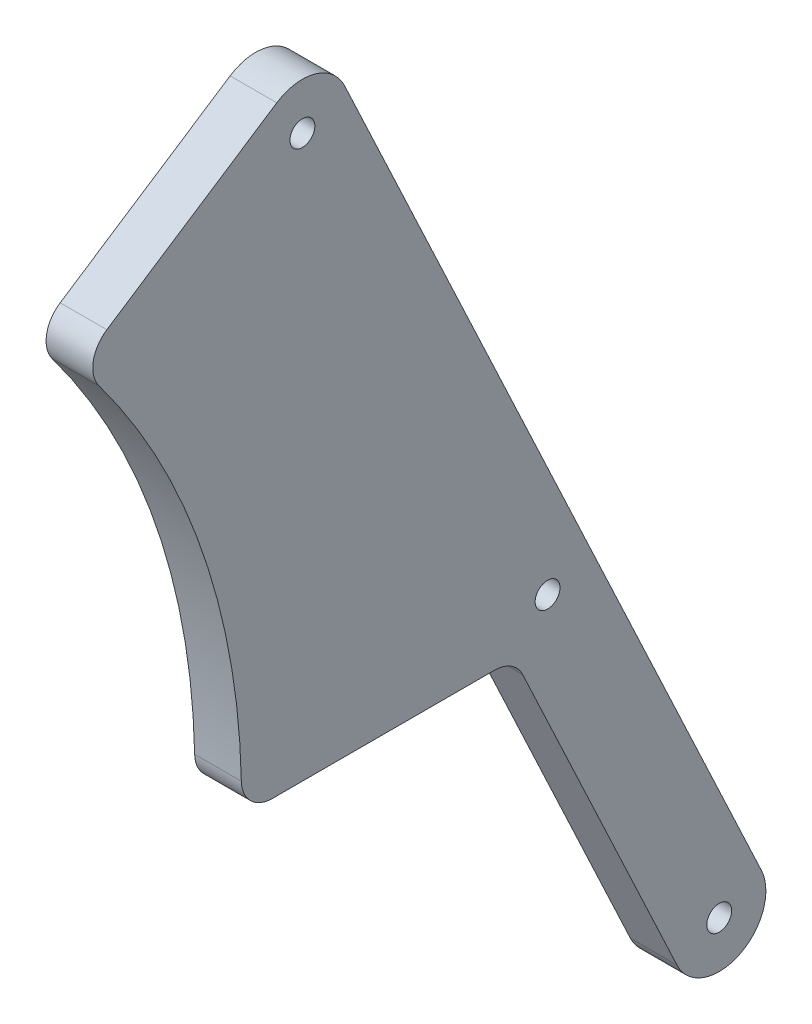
ISO-10303-21;
HEADER;
FILE_DESCRIPTION(('STEP AP214'),'2;1');
FILE_NAME('part.step','',(''),(''),'','','');
FILE_SCHEMA(('AUTOMOTIVE_DESIGN { 1 0 10303 214 1 1 1 1 }'));
ENDSEC;
DATA;
#1=APPLICATION_CONTEXT('core data for automotive mechanical design processes');
#2=APPLICATION_PROTOCOL_DEFINITION('international standard','automotive_design',2000,#1);
#3=PRODUCT_CONTEXT('',#1,'mechanical');
#4=PRODUCT('Part','Part','',(#3));
#5=PRODUCT_RELATED_PRODUCT_CATEGORY('part','',(#4));
#6=PRODUCT_DEFINITION_FORMATION('','',#4);
#7=PRODUCT_DEFINITION_CONTEXT('part definition',#1,'design');
#8=PRODUCT_DEFINITION('design','',#6,#7);
#9=PRODUCT_DEFINITION_SHAPE('','',#8);
#10=(LENGTH_UNIT() NAMED_UNIT(*) SI_UNIT(.MILLI.,.METRE.));
#11=(NAMED_UNIT(*) PLANE_ANGLE_UNIT() SI_UNIT($,.RADIAN.));
#12=(NAMED_UNIT(*) SI_UNIT($,.STERADIAN.) SOLID_ANGLE_UNIT());
#13=UNCERTAINTY_MEASURE_WITH_UNIT(LENGTH_MEASURE(1.E-05),#10,'distance_accuracy_value','');
#14=(GEOMETRIC_REPRESENTATION_CONTEXT(3) GLOBAL_UNCERTAINTY_ASSIGNED_CONTEXT((#13)) GLOBAL_UNIT_ASSIGNED_CONTEXT((#10,
#11,#12)) REPRESENTATION_CONTEXT('',''));
#15=CARTESIAN_POINT('',(0.,0.,0.));
#16=DIRECTION('',(0.,0.,1.));
#17=DIRECTION('',(1.,0.,0.));
#18=AXIS2_PLACEMENT_3D('',#15,#16,#17);
#19=CARTESIAN_POINT('',(15.,4908.15340193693,-12944.9318223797));
#20=DIRECTION('',(0.,-0.836075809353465,-0.548613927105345));
#21=DIRECTION('',(0.,0.548613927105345,-0.836075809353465));
#22=AXIS2_PLACEMENT_3D('',#19,#20,#21);
#23=PLANE('',#22);
#24=DIRECTION('',(0.,-0.548613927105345,0.836075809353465));
#25=VECTOR('',#24,1.);
#26=CARTESIAN_POINT('',(0.,4908.15340193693,-12944.9318223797));
#27=LINE('',#26,#25);
#28=CARTESIAN_POINT('',(0.,4949.96478873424,-13008.6514753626));
#29=VERTEX_POINT('',#28);
#30=CARTESIAN_POINT('',(0.,4914.12250729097,-12954.028610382));
#31=VERTEX_POINT('',#30);
#32=EDGE_CURVE('E150',#29,#31,#27,.T.);
#33=ORIENTED_EDGE('',*,*,#32,.T.);
#34=DIRECTION('',(-1.,0.,0.));
#35=VECTOR('',#34,1.);
#36=CARTESIAN_POINT('',(15.,4914.12250729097,-12954.028610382));
#37=LINE('',#36,#35);
#38=CARTESIAN_POINT('',(15.,4914.12250729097,-12954.028610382));
#39=VERTEX_POINT('',#38);
#40=EDGE_CURVE('E197',#31,#39,#37,.F.);
#41=ORIENTED_EDGE('',*,*,#40,.T.);
#42=DIRECTION('',(0.,-0.548613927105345,0.836075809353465));
#43=VECTOR('',#42,1.);
#44=CARTESIAN_POINT('',(15.,4908.15340193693,-12944.9318223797));
#45=LINE('',#44,#43);
#46=CARTESIAN_POINT('',(15.,4949.96478873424,-13008.6514753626));
#47=VERTEX_POINT('',#46);
#48=EDGE_CURVE('E165',#47,#39,#45,.T.);
#49=ORIENTED_EDGE('',*,*,#48,.F.);
#50=DIRECTION('',(-1.,0.,0.));
#51=VECTOR('',#50,1.);
#52=CARTESIAN_POINT('',(15.,4949.96478873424,-13008.6514753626));
#53=LINE('',#52,#51);
#54=EDGE_CURVE('E136',#47,#29,#53,.T.);
#55=ORIENTED_EDGE('',*,*,#54,.T.);
#56=EDGE_LOOP('',(#33,#41,#49,#55));
#57=FACE_BOUND('',#56,.T.);
#58=ADVANCED_FACE('F35',(#57),#23,.F.);
#59=CARTESIAN_POINT('',(15.,4762.0371923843,-12767.3084756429));
#60=DIRECTION('',(-1.,0.,0.));
#61=DIRECTION('',(0.,0.,1.));
#62=AXIS2_PLACEMENT_3D('',#59,#60,#61);
#63=CYLINDRICAL_SURFACE('',#62,229.999999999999);
#64=CARTESIAN_POINT('',(0.,4762.0371923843,-12767.3084756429));
#65=DIRECTION('',(-1.,0.,0.));
#66=DIRECTION('',(0.,0.,-1.));
#67=AXIS2_PLACEMENT_3D('',#64,#65,#66);
#68=CIRCLE('',#67,229.999999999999);
#69=CARTESIAN_POINT('',(0.,4899.77322599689,-12951.5061549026));
#70=VERTEX_POINT('',#69);
#71=CARTESIAN_POINT('',(0.,4766.82885905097,-12997.2585570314));
#72=VERTEX_POINT('',#71);
#73=EDGE_CURVE('E153',#70,#72,#68,.T.);
#74=ORIENTED_EDGE('',*,*,#73,.T.);
#75=DIRECTION('',(-1.,0.,0.));
#76=VECTOR('',#75,1.);
#77=CARTESIAN_POINT('',(15.,4766.82885905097,-12997.2585570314));
#78=LINE('',#77,#76);
#79=CARTESIAN_POINT('',(15.,4766.82885905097,-12997.2585570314));
#80=VERTEX_POINT('',#79);
#81=EDGE_CURVE('E43',#72,#80,#78,.F.);
#82=ORIENTED_EDGE('',*,*,#81,.T.);
#83=CARTESIAN_POINT('',(15.,4762.0371923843,-12767.3084756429));
#84=DIRECTION('',(-1.,0.,0.));
#85=DIRECTION('',(0.,0.,-1.));
#86=AXIS2_PLACEMENT_3D('',#83,#84,#85);
#87=CIRCLE('',#86,229.999999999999);
#88=CARTESIAN_POINT('',(15.,4899.77322599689,-12951.5061549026));
#89=VERTEX_POINT('',#88);
#90=EDGE_CURVE('E128',#89,#80,#87,.T.);
#91=ORIENTED_EDGE('',*,*,#90,.F.);
#92=DIRECTION('',(-1.,0.,0.));
#93=VECTOR('',#92,1.);
#94=CARTESIAN_POINT('',(15.,4899.77322599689,-12951.5061549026));
#95=LINE('',#94,#93);
#96=EDGE_CURVE('E192',#89,#70,#95,.T.);
#97=ORIENTED_EDGE('',*,*,#96,.T.);
#98=EDGE_LOOP('',(#74,#82,#91,#97));
#99=FACE_BOUND('',#98,.T.);
#100=ADVANCED_FACE('F282',(#99),#63,.F.);
#101=CARTESIAN_POINT('',(15.,4757.0371923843,-12997.2541213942));
#102=DIRECTION('',(0.,1.,0.));
#103=DIRECTION('',(0.,0.,1.));
#104=AXIS2_PLACEMENT_3D('',#101,#102,#103);
#105=PLANE('',#104);
#106=DIRECTION('',(0.,0.,-1.));
#107=VECTOR('',#106,1.);
#108=CARTESIAN_POINT('',(15.,4757.0371923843,-12997.2541213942));
#109=LINE('',#108,#107);
#110=CARTESIAN_POINT('',(15.,4757.0371923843,-13007.2563866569));
#111=VERTEX_POINT('',#110);
#112=CARTESIAN_POINT('',(15.,4757.0371923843,-13078.6351860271));
#113=VERTEX_POINT('',#112);
#114=EDGE_CURVE('E117',#111,#113,#109,.T.);
#115=ORIENTED_EDGE('',*,*,#114,.F.);
#116=DIRECTION('',(-1.,0.,0.));
#117=VECTOR('',#116,1.);
#118=CARTESIAN_POINT('',(15.,4757.0371923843,-13007.2563866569));
#119=LINE('',#118,#117);
#120=CARTESIAN_POINT('',(0.,4757.0371923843,-13007.2563866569));
#121=VERTEX_POINT('',#120);
#122=EDGE_CURVE('E201',#111,#121,#119,.T.);
#123=ORIENTED_EDGE('',*,*,#122,.T.);
#124=DIRECTION('',(0.,0.,-1.));
#125=VECTOR('',#124,1.);
#126=CARTESIAN_POINT('',(0.,4757.0371923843,-12997.2541213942));
#127=LINE('',#126,#125);
#128=CARTESIAN_POINT('',(0.,4757.0371923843,-13078.6351860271));
#129=VERTEX_POINT('',#128);
#130=EDGE_CURVE('E133',#121,#129,#127,.T.);
#131=ORIENTED_EDGE('',*,*,#130,.T.);
#132=DIRECTION('',(-1.,0.,0.));
#133=VECTOR('',#132,1.);
#134=CARTESIAN_POINT('',(15.,4757.0371923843,-13078.6351860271));
#135=LINE('',#134,#133);
#136=EDGE_CURVE('E131',#113,#129,#135,.T.);
#137=ORIENTED_EDGE('',*,*,#136,.F.);
#138=EDGE_LOOP('',(#115,#123,#131,#137));
#139=FACE_BOUND('',#138,.T.);
#140=ADVANCED_FACE('F132',(#139),#105,.F.);
#141=CARTESIAN_POINT('',(15.,4747.0371923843,-13078.6351860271));
#142=DIRECTION('',(-1.,0.,0.));
#143=DIRECTION('',(0.,0.,1.));
#144=AXIS2_PLACEMENT_3D('',#141,#142,#143);
#145=CYLINDRICAL_SURFACE('',#144,10.0000000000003);
#146=CARTESIAN_POINT('',(0.,4747.0371923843,-13078.6351860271));
#147=DIRECTION('',(-1.,0.,0.));
#148=DIRECTION('',(0.,0.,-1.));
#149=AXIS2_PLACEMENT_3D('',#146,#147,#148);
#150=CIRCLE('',#149,10.0000000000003);
#151=CARTESIAN_POINT('',(0.,4751.28653229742,-13087.6874294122));
#152=VERTEX_POINT('',#151);
#153=EDGE_CURVE('E157',#129,#152,#150,.T.);
#154=ORIENTED_EDGE('',*,*,#153,.T.);
#155=DIRECTION('',(-1.,0.,0.));
#156=VECTOR('',#155,1.);
#157=CARTESIAN_POINT('',(15.,4751.28653229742,-13087.6874294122));
#158=LINE('',#157,#156);
#159=CARTESIAN_POINT('',(15.,4751.28653229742,-13087.6874294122));
#160=VERTEX_POINT('',#159);
#161=EDGE_CURVE('E137',#160,#152,#158,.T.);
#162=ORIENTED_EDGE('',*,*,#161,.F.);
#163=CARTESIAN_POINT('',(15.,4747.0371923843,-13078.6351860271));
#164=DIRECTION('',(-1.,0.,0.));
#165=DIRECTION('',(0.,0.,-1.));
#166=AXIS2_PLACEMENT_3D('',#163,#164,#165);
#167=CIRCLE('',#166,10.0000000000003);
#168=EDGE_CURVE('E122',#113,#160,#167,.T.);
#169=ORIENTED_EDGE('',*,*,#168,.F.);
#170=ORIENTED_EDGE('',*,*,#136,.T.);
#171=EDGE_LOOP('',(#154,#162,#169,#170));
#172=FACE_BOUND('',#171,.T.);
#173=ADVANCED_FACE('F139',(#172),#145,.F.);
#174=CARTESIAN_POINT('',(15.,4751.28653229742,-13087.6874294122));
#175=DIRECTION('',(0.,0.424933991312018,-0.905224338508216));
#176=DIRECTION('',(0.,0.905224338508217,0.424933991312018));
#177=AXIS2_PLACEMENT_3D('',#174,#175,#176);
#178=PLANE('',#177);
#179=DIRECTION('',(0.,-0.905224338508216,-0.424933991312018));
#180=VECTOR('',#179,1.);
#181=CARTESIAN_POINT('',(0.,4751.28653229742,-13087.6874294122));
#182=LINE('',#181,#180);
#183=CARTESIAN_POINT('',(0.,4645.66318251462,-13137.2695602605));
#184=VERTEX_POINT('',#183);
#185=EDGE_CURVE('E159',#152,#184,#182,.T.);
#186=ORIENTED_EDGE('',*,*,#185,.T.);
#187=DIRECTION('',(-1.,0.,0.));
#188=VECTOR('',#187,1.);
#189=CARTESIAN_POINT('',(15.,4645.66318251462,-13137.2695602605));
#190=LINE('',#189,#188);
#191=CARTESIAN_POINT('',(15.,4645.66318251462,-13137.2695602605));
#192=VERTEX_POINT('',#191);
#193=EDGE_CURVE('E188',#184,#192,#190,.F.);
#194=ORIENTED_EDGE('',*,*,#193,.T.);
#195=DIRECTION('',(0.,-0.905224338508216,-0.424933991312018));
#196=VECTOR('',#195,1.);
#197=CARTESIAN_POINT('',(15.,4751.28653229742,-13087.6874294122));
#198=LINE('',#197,#196);
#199=EDGE_CURVE('E142',#160,#192,#198,.T.);
#200=ORIENTED_EDGE('',*,*,#199,.F.);
#201=ORIENTED_EDGE('',*,*,#161,.T.);
#202=EDGE_LOOP('',(#186,#194,#200,#201));
#203=FACE_BOUND('',#202,.T.);
#204=ADVANCED_FACE('F207',(#203),#178,.F.);
#205=CARTESIAN_POINT('',(15.,4959.45237463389,-13023.1103519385));
#206=DIRECTION('',(0.,-0.424933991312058,0.905224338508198));
#207=DIRECTION('',(0.,-0.905224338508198,-0.424933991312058));
#208=AXIS2_PLACEMENT_3D('',#205,#206,#207);
#209=PLANE('',#208);
#210=DIRECTION('',(0.,0.905224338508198,0.424933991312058));
#211=VECTOR('',#210,1.);
#212=CARTESIAN_POINT('',(0.,4959.45237463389,-13023.1103519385));
#213=LINE('',#212,#211);
#214=CARTESIAN_POINT('',(0.,4658.41120225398,-13164.4262904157));
#215=VERTEX_POINT('',#214);
#216=CARTESIAN_POINT('',(0.,4943.79766146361,-13030.4590493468));
#217=VERTEX_POINT('',#216);
#218=EDGE_CURVE('E162',#215,#217,#213,.T.);
#219=ORIENTED_EDGE('',*,*,#218,.T.);
#220=DIRECTION('',(-1.,0.,0.));
#221=VECTOR('',#220,1.);
#222=CARTESIAN_POINT('',(15.,4943.79766146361,-13030.4590493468));
#223=LINE('',#222,#221);
#224=CARTESIAN_POINT('',(15.,4943.79766146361,-13030.4590493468));
#225=VERTEX_POINT('',#224);
#226=EDGE_CURVE('E177',#217,#225,#223,.F.);
#227=ORIENTED_EDGE('',*,*,#226,.T.);
#228=DIRECTION('',(0.,0.905224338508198,0.424933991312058));
#229=VECTOR('',#228,1.);
#230=CARTESIAN_POINT('',(15.,4959.45237463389,-13023.1103519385));
#231=LINE('',#230,#229);
#232=CARTESIAN_POINT('',(15.,4658.41120225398,-13164.4262904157));
#233=VERTEX_POINT('',#232);
#234=EDGE_CURVE('E144',#233,#225,#231,.T.);
#235=ORIENTED_EDGE('',*,*,#234,.F.);
#236=DIRECTION('',(-1.,0.,0.));
#237=VECTOR('',#236,1.);
#238=CARTESIAN_POINT('',(15.,4658.41120225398,-13164.4262904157));
#239=LINE('',#238,#237);
#240=EDGE_CURVE('E174',#233,#215,#239,.T.);
#241=ORIENTED_EDGE('',*,*,#240,.T.);
#242=EDGE_LOOP('',(#219,#227,#235,#241));
#243=FACE_BOUND('',#242,.T.);
#244=ADVANCED_FACE('F220',(#243),#209,.F.);
#245=CARTESIAN_POINT('',(15.,4747.0371923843,-13078.6351860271));
#246=DIRECTION('',(1.,0.,0.));
#247=DIRECTION('',(0.,0.,-1.));
#248=AXIS2_PLACEMENT_3D('',#245,#246,#247);
#249=PLANE('',#248);
#250=CARTESIAN_POINT('',(15.,4769.5371923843,-13095.6906103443));
#251=DIRECTION('',(1.,0.,0.));
#252=DIRECTION('',(0.,0.,-1.));
#253=AXIS2_PLACEMENT_3D('',#250,#251,#252);
#254=CIRCLE('',#253,4.00000000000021);
#255=CARTESIAN_POINT('',(15.,4769.5371923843,-13099.6906103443));
#256=VERTEX_POINT('',#255);
#257=EDGE_CURVE('E246',#256,#256,#254,.T.);
#258=ORIENTED_EDGE('',*,*,#257,.F.);
#259=EDGE_LOOP('',(#258));
#260=FACE_BOUND('',#259,.T.);
#261=CARTESIAN_POINT('',(15.,4652.0371923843,-13150.8479253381));
#262=DIRECTION('',(1.,0.,0.));
#263=DIRECTION('',(0.,0.,-1.));
#264=AXIS2_PLACEMENT_3D('',#261,#262,#263);
#265=CIRCLE('',#264,4.00000000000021);
#266=CARTESIAN_POINT('',(15.,4652.0371923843,-13154.8479253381));
#267=VERTEX_POINT('',#266);
#268=EDGE_CURVE('E240',#267,#267,#265,.T.);
#269=ORIENTED_EDGE('',*,*,#268,.F.);
#270=EDGE_LOOP('',(#269));
#271=FACE_BOUND('',#270,.T.);
#272=CARTESIAN_POINT('',(15.,4937.42365159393,-13016.8806842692));
#273=DIRECTION('',(1.,0.,0.));
#274=DIRECTION('',(0.,0.,-1.));
#275=AXIS2_PLACEMENT_3D('',#272,#273,#274);
#276=CIRCLE('',#275,4.00000000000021);
#277=CARTESIAN_POINT('',(15.,4937.42365159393,-13020.8806842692));
#278=VERTEX_POINT('',#277);
#279=EDGE_CURVE('E234',#278,#278,#276,.T.);
#280=ORIENTED_EDGE('',*,*,#279,.F.);
#281=EDGE_LOOP('',(#280));
#282=FACE_BOUND('',#281,.T.);
#283=ORIENTED_EDGE('',*,*,#90,.T.);
#284=CARTESIAN_POINT('',(15.,4767.0371923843,-13007.2563866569));
#285=DIRECTION('',(1.,0.,0.));
#286=DIRECTION('',(0.,0.,-1.));
#287=AXIS2_PLACEMENT_3D('',#284,#285,#286);
#288=CIRCLE('',#287,10.);
#289=EDGE_CURVE('E11',#80,#111,#288,.T.);
#290=ORIENTED_EDGE('',*,*,#289,.T.);
#291=ORIENTED_EDGE('',*,*,#114,.T.);
#292=ORIENTED_EDGE('',*,*,#168,.T.);
#293=ORIENTED_EDGE('',*,*,#199,.T.);
#294=CARTESIAN_POINT('',(15.,4652.0371923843,-13150.8479253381));
#295=DIRECTION('',(1.,0.,0.));
#296=DIRECTION('',(0.,0.,-1.));
#297=AXIS2_PLACEMENT_3D('',#294,#295,#296);
#298=CIRCLE('',#297,15.);
#299=CARTESIAN_POINT('',(15.,4637.0371923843,-13150.8479253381));
#300=VERTEX_POINT('',#299);
#301=EDGE_CURVE('E190',#192,#300,#298,.T.);
#302=ORIENTED_EDGE('',*,*,#301,.T.);
#303=CARTESIAN_POINT('',(15.,4652.0371923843,-13150.8479253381));
#304=DIRECTION('',(1.,0.,0.));
#305=DIRECTION('',(0.,0.,-1.));
#306=AXIS2_PLACEMENT_3D('',#303,#304,#305);
#307=CIRCLE('',#306,15.);
#308=EDGE_CURVE('E179',#300,#233,#307,.T.);
#309=ORIENTED_EDGE('',*,*,#308,.T.);
#310=ORIENTED_EDGE('',*,*,#234,.T.);
#311=CARTESIAN_POINT('',(15.,4937.42365159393,-13016.8806842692));
#312=DIRECTION('',(1.,0.,0.));
#313=DIRECTION('',(0.,0.,-1.));
#314=AXIS2_PLACEMENT_3D('',#311,#312,#313);
#315=CIRCLE('',#314,15.);
#316=EDGE_CURVE('E181',#225,#47,#315,.T.);
#317=ORIENTED_EDGE('',*,*,#316,.T.);
#318=ORIENTED_EDGE('',*,*,#48,.T.);
#319=CARTESIAN_POINT('',(15.,4905.76174919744,-12959.5147496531));
#320=DIRECTION('',(1.,0.,0.));
#321=DIRECTION('',(0.,0.,-1.));
#322=AXIS2_PLACEMENT_3D('',#319,#320,#321);
#323=CIRCLE('',#322,10.);
#324=EDGE_CURVE('E199',#39,#89,#323,.T.);
#325=ORIENTED_EDGE('',*,*,#324,.T.);
#326=EDGE_LOOP('',(#283,#290,#291,#292,#293,#302,#309,#310,#317,#318,#325));
#327=FACE_BOUND('',#326,.T.);
#328=ADVANCED_FACE('F119',(#260,#271,#282,#327),#249,.T.);
#329=CARTESIAN_POINT('',(0.,4747.0371923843,-13078.6351860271));
#330=DIRECTION('',(1.,0.,0.));
#331=DIRECTION('',(0.,0.,-1.));
#332=AXIS2_PLACEMENT_3D('',#329,#330,#331);
#333=PLANE('',#332);
#334=CARTESIAN_POINT('',(0.,4769.5371923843,-13095.6906103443));
#335=DIRECTION('',(1.,0.,0.));
#336=DIRECTION('',(0.,0.,-1.));
#337=AXIS2_PLACEMENT_3D('',#334,#335,#336);
#338=CIRCLE('',#337,4.00000000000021);
#339=CARTESIAN_POINT('',(0.,4769.5371923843,-13099.6906103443));
#340=VERTEX_POINT('',#339);
#341=EDGE_CURVE('E243',#340,#340,#338,.T.);
#342=ORIENTED_EDGE('',*,*,#341,.T.);
#343=EDGE_LOOP('',(#342));
#344=FACE_BOUND('',#343,.T.);
#345=CARTESIAN_POINT('',(0.,4652.0371923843,-13150.8479253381));
#346=DIRECTION('',(1.,0.,0.));
#347=DIRECTION('',(0.,0.,-1.));
#348=AXIS2_PLACEMENT_3D('',#345,#346,#347);
#349=CIRCLE('',#348,4.00000000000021);
#350=CARTESIAN_POINT('',(0.,4652.0371923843,-13154.8479253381));
#351=VERTEX_POINT('',#350);
#352=EDGE_CURVE('E237',#351,#351,#349,.T.);
#353=ORIENTED_EDGE('',*,*,#352,.T.);
#354=EDGE_LOOP('',(#353));
#355=FACE_BOUND('',#354,.T.);
#356=CARTESIAN_POINT('',(0.,4937.42365159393,-13016.8806842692));
#357=DIRECTION('',(1.,0.,0.));
#358=DIRECTION('',(0.,0.,-1.));
#359=AXIS2_PLACEMENT_3D('',#356,#357,#358);
#360=CIRCLE('',#359,4.00000000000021);
#361=CARTESIAN_POINT('',(0.,4937.42365159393,-13020.8806842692));
#362=VERTEX_POINT('',#361);
#363=EDGE_CURVE('E154',#362,#362,#360,.T.);
#364=ORIENTED_EDGE('',*,*,#363,.T.);
#365=EDGE_LOOP('',(#364));
#366=FACE_BOUND('',#365,.T.);
#367=ORIENTED_EDGE('',*,*,#130,.F.);
#368=CARTESIAN_POINT('',(0.,4767.0371923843,-13007.2563866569));
#369=DIRECTION('',(1.,0.,0.));
#370=DIRECTION('',(0.,0.,-1.));
#371=AXIS2_PLACEMENT_3D('',#368,#369,#370);
#372=CIRCLE('',#371,10.);
#373=EDGE_CURVE('E57',#121,#72,#372,.F.);
#374=ORIENTED_EDGE('',*,*,#373,.T.);
#375=ORIENTED_EDGE('',*,*,#73,.F.);
#376=CARTESIAN_POINT('',(0.,4905.76174919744,-12959.5147496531));
#377=DIRECTION('',(1.,0.,0.));
#378=DIRECTION('',(0.,0.,-1.));
#379=AXIS2_PLACEMENT_3D('',#376,#377,#378);
#380=CIRCLE('',#379,10.);
#381=EDGE_CURVE('E195',#70,#31,#380,.F.);
#382=ORIENTED_EDGE('',*,*,#381,.T.);
#383=ORIENTED_EDGE('',*,*,#32,.F.);
#384=CARTESIAN_POINT('',(0.,4937.42365159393,-13016.8806842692));
#385=DIRECTION('',(1.,0.,0.));
#386=DIRECTION('',(0.,0.,-1.));
#387=AXIS2_PLACEMENT_3D('',#384,#385,#386);
#388=CIRCLE('',#387,15.);
#389=EDGE_CURVE('E172',#29,#217,#388,.F.);
#390=ORIENTED_EDGE('',*,*,#389,.T.);
#391=ORIENTED_EDGE('',*,*,#218,.F.);
#392=CARTESIAN_POINT('',(0.,4652.0371923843,-13150.8479253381));
#393=DIRECTION('',(1.,0.,0.));
#394=DIRECTION('',(0.,0.,-1.));
#395=AXIS2_PLACEMENT_3D('',#392,#393,#394);
#396=CIRCLE('',#395,15.);
#397=CARTESIAN_POINT('',(0.,4637.0371923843,-13150.8479253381));
#398=VERTEX_POINT('',#397);
#399=EDGE_CURVE('E169',#215,#398,#396,.F.);
#400=ORIENTED_EDGE('',*,*,#399,.T.);
#401=CARTESIAN_POINT('',(0.,4652.0371923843,-13150.8479253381));
#402=DIRECTION('',(1.,0.,0.));
#403=DIRECTION('',(0.,0.,-1.));
#404=AXIS2_PLACEMENT_3D('',#401,#402,#403);
#405=CIRCLE('',#404,15.);
#406=EDGE_CURVE('E186',#398,#184,#405,.F.);
#407=ORIENTED_EDGE('',*,*,#406,.T.);
#408=ORIENTED_EDGE('',*,*,#185,.F.);
#409=ORIENTED_EDGE('',*,*,#153,.F.);
#410=EDGE_LOOP('',(#367,#374,#375,#382,#383,#390,#391,#400,#407,#408,#409));
#411=FACE_BOUND('',#410,.T.);
#412=ADVANCED_FACE('F204',(#344,#355,#366,#411),#333,.F.);
#413=CARTESIAN_POINT('',(15.,4937.42365159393,-13016.8806842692));
#414=DIRECTION('',(-1.,0.,0.));
#415=DIRECTION('',(0.,0.,1.));
#416=AXIS2_PLACEMENT_3D('',#413,#414,#415);
#417=CYLINDRICAL_SURFACE('',#416,15.);
#418=ORIENTED_EDGE('',*,*,#316,.F.);
#419=ORIENTED_EDGE('',*,*,#226,.F.);
#420=ORIENTED_EDGE('',*,*,#389,.F.);
#421=ORIENTED_EDGE('',*,*,#54,.F.);
#422=EDGE_LOOP('',(#418,#419,#420,#421));
#423=FACE_BOUND('',#422,.T.);
#424=ADVANCED_FACE('F224',(#423),#417,.T.);
#425=CARTESIAN_POINT('',(15.,4652.0371923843,-13150.8479253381));
#426=DIRECTION('',(-1.,0.,0.));
#427=DIRECTION('',(0.,0.,1.));
#428=AXIS2_PLACEMENT_3D('',#425,#426,#427);
#429=CYLINDRICAL_SURFACE('',#428,15.);
#430=ORIENTED_EDGE('',*,*,#308,.F.);
#431=DIRECTION('',(-1.,0.,0.));
#432=VECTOR('',#431,1.);
#433=CARTESIAN_POINT('',(15.,4637.0371923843,-13150.8479253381));
#434=LINE('',#433,#432);
#435=EDGE_CURVE('E183',#398,#300,#434,.F.);
#436=ORIENTED_EDGE('',*,*,#435,.F.);
#437=ORIENTED_EDGE('',*,*,#399,.F.);
#438=ORIENTED_EDGE('',*,*,#240,.F.);
#439=EDGE_LOOP('',(#430,#436,#437,#438));
#440=FACE_BOUND('',#439,.T.);
#441=ADVANCED_FACE('F215',(#440),#429,.T.);
#442=CARTESIAN_POINT('',(15.,4652.0371923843,-13150.8479253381));
#443=DIRECTION('',(-1.,0.,0.));
#444=DIRECTION('',(0.,0.,1.));
#445=AXIS2_PLACEMENT_3D('',#442,#443,#444);
#446=CYLINDRICAL_SURFACE('',#445,15.);
#447=ORIENTED_EDGE('',*,*,#301,.F.);
#448=ORIENTED_EDGE('',*,*,#193,.F.);
#449=ORIENTED_EDGE('',*,*,#406,.F.);
#450=ORIENTED_EDGE('',*,*,#435,.T.);
#451=EDGE_LOOP('',(#447,#448,#449,#450));
#452=FACE_BOUND('',#451,.T.);
#453=ADVANCED_FACE('F212',(#452),#446,.T.);
#454=CARTESIAN_POINT('',(0.,4937.42365159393,-13016.8806842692));
#455=DIRECTION('',(1.,0.,0.));
#456=DIRECTION('',(0.,0.,-1.));
#457=AXIS2_PLACEMENT_3D('',#454,#455,#456);
#458=CYLINDRICAL_SURFACE('',#457,4.00000000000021);
#459=ORIENTED_EDGE('',*,*,#363,.F.);
#460=EDGE_LOOP('',(#459));
#461=FACE_BOUND('',#460,.T.);
#462=ORIENTED_EDGE('',*,*,#279,.T.);
#463=EDGE_LOOP('',(#462));
#464=FACE_BOUND('',#463,.T.);
#465=ADVANCED_FACE('F269',(#461,#464),#458,.F.);
#466=CARTESIAN_POINT('',(0.,4652.0371923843,-13150.8479253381));
#467=DIRECTION('',(1.,0.,0.));
#468=DIRECTION('',(0.,0.,-1.));
#469=AXIS2_PLACEMENT_3D('',#466,#467,#468);
#470=CYLINDRICAL_SURFACE('',#469,4.00000000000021);
#471=ORIENTED_EDGE('',*,*,#352,.F.);
#472=EDGE_LOOP('',(#471));
#473=FACE_BOUND('',#472,.T.);
#474=ORIENTED_EDGE('',*,*,#268,.T.);
#475=EDGE_LOOP('',(#474));
#476=FACE_BOUND('',#475,.T.);
#477=ADVANCED_FACE('F258',(#473,#476),#470,.F.);
#478=CARTESIAN_POINT('',(0.,4769.5371923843,-13095.6906103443));
#479=DIRECTION('',(1.,0.,0.));
#480=DIRECTION('',(0.,0.,-1.));
#481=AXIS2_PLACEMENT_3D('',#478,#479,#480);
#482=CYLINDRICAL_SURFACE('',#481,4.00000000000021);
#483=ORIENTED_EDGE('',*,*,#341,.F.);
#484=EDGE_LOOP('',(#483));
#485=FACE_BOUND('',#484,.T.);
#486=ORIENTED_EDGE('',*,*,#257,.T.);
#487=EDGE_LOOP('',(#486));
#488=FACE_BOUND('',#487,.T.);
#489=ADVANCED_FACE('F254',(#485,#488),#482,.F.);
#490=CARTESIAN_POINT('',(15.,4905.76174919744,-12959.5147496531));
#491=DIRECTION('',(-1.,0.,0.));
#492=DIRECTION('',(0.,0.,1.));
#493=AXIS2_PLACEMENT_3D('',#490,#491,#492);
#494=CYLINDRICAL_SURFACE('',#493,10.);
#495=ORIENTED_EDGE('',*,*,#324,.F.);
#496=ORIENTED_EDGE('',*,*,#40,.F.);
#497=ORIENTED_EDGE('',*,*,#381,.F.);
#498=ORIENTED_EDGE('',*,*,#96,.F.);
#499=EDGE_LOOP('',(#495,#496,#497,#498));
#500=FACE_BOUND('',#499,.T.);
#501=ADVANCED_FACE('F257',(#500),#494,.T.);
#502=CARTESIAN_POINT('',(15.,4767.0371923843,-13007.2563866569));
#503=DIRECTION('',(-1.,0.,0.));
#504=DIRECTION('',(0.,0.,1.));
#505=AXIS2_PLACEMENT_3D('',#502,#503,#504);
#506=CYLINDRICAL_SURFACE('',#505,10.);
#507=ORIENTED_EDGE('',*,*,#289,.F.);
#508=ORIENTED_EDGE('',*,*,#81,.F.);
#509=ORIENTED_EDGE('',*,*,#373,.F.);
#510=ORIENTED_EDGE('',*,*,#122,.F.);
#511=EDGE_LOOP('',(#507,#508,#509,#510));
#512=FACE_BOUND('',#511,.T.);
#513=ADVANCED_FACE('F37',(#512),#506,.T.);
#514=CLOSED_SHELL('',(#58,#100,#140,#173,#204,#244,#328,#412,#424,#441,#453,#465,#477,#489,#501,#513));
#515=MANIFOLD_SOLID_BREP('B2',#514);
#516=ADVANCED_BREP_SHAPE_REPRESENTATION('',(#18,#515),#14);
#517=SHAPE_DEFINITION_REPRESENTATION(#9,#516);
ENDSEC;
END-ISO-10303-21;
